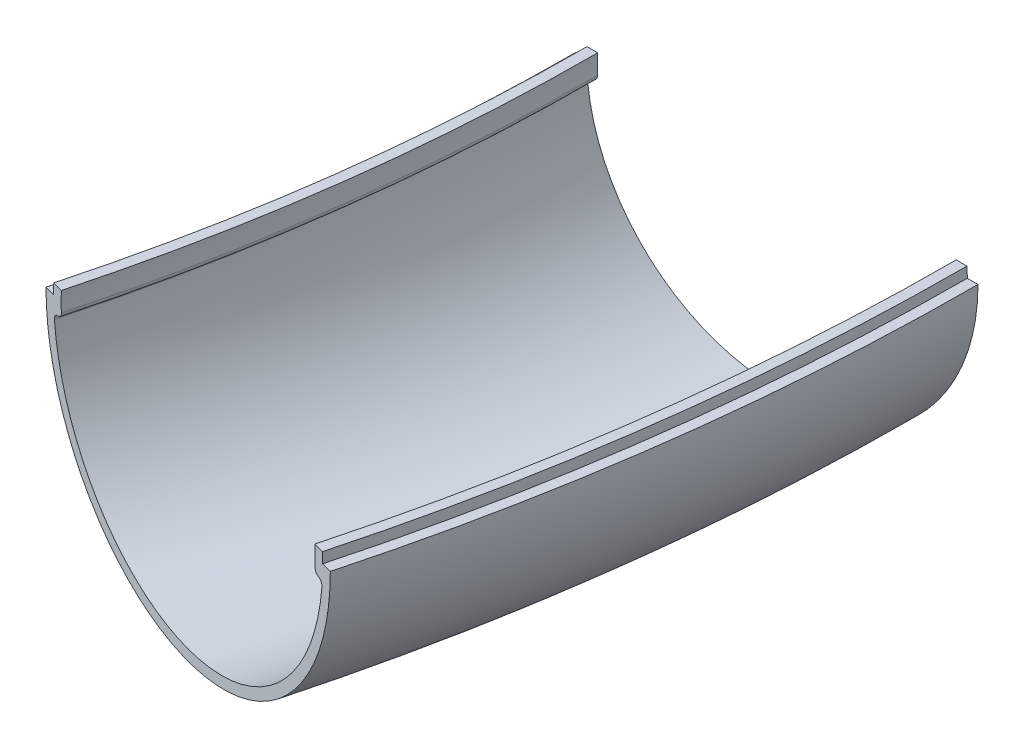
from build123d import *

# Parameters (mm, degrees)
REVOLVE_1_ANGLE = 15


with BuildPart() as part:
    # Sketch 1 → Revolve 1 (revolve)
    with BuildSketch(Plane.XY):
        with BuildLine():
            Line((163.782205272, -1.100583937), (163.718172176, -1.100583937))
            ThreePointArc((163.718172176, -1.100583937), (164.015996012, -1.233561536), (164.115800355, -1.544079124))
            ThreePointArc((164.115800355, -1.544079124), (150, -14.2), (135.884199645, -1.544079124))
            ThreePointArc((135.884199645, -1.544079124), (135.984003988, -1.233561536), (136.281827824, -1.100583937))
            Line((136.281827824, -1.100583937), (136.217794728, -1.100583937))
            ThreePointArc((136.217794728, -1.100583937), (136.507728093, -0.976153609), (136.617278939, -0.680277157))
            ThreePointArc((136.617278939, -0.680277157), (136.600087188, 0.048338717), (136.622535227, 0.776811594))
            Line((136.622535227, 0.776811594), (135.821263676, 0.776811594))
            ThreePointArc((135.821263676, 0.776811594), (135.805316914, 0.388551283), (135.8, 0))
            Line((135.8, 0), (135, 0))
            ThreePointArc((135, 0), (150, -15), (165, 0))
            Line((165, 0), (164.2, 0))
            ThreePointArc((164.2, 0), (164.194683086, 0.388551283), (164.178736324, 0.776811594))
            Line((164.178736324, 0.776811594), (163.377464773, 0.776811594))
            ThreePointArc((163.377464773, 0.776811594), (163.399912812, 0.048338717), (163.382721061, -0.680277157))
            ThreePointArc((163.382721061, -0.680277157), (163.492271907, -0.976153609), (163.782205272, -1.100583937))
        make_face()
    revolve(axis=Axis((0, 44.11016669, 0), (0, -1, 0)), revolution_arc=REVOLVE_1_ANGLE)


solid = part.part
